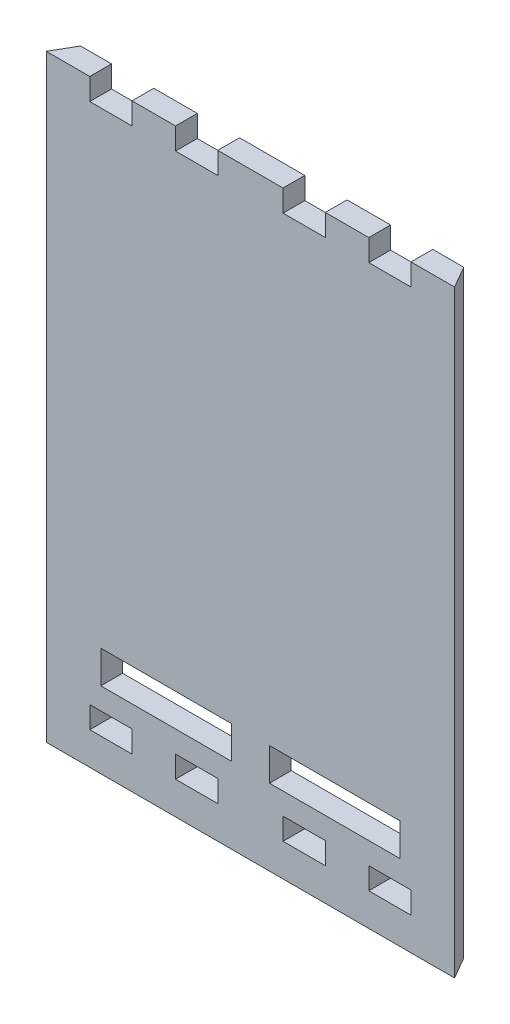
from build123d import *

# Parameters (mm, degrees)
SKETCH1_W           = 3.881941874
SKETCH1_H           = 2
SKETCH1_W_2         = 3.881941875
BOSS_EXTRUDE1_DEPTH = 2
CUT_EXTRUDE1_DEPTH  = 67.613311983
SKETCH4_W           = 12
SKETCH4_H           = 3
CUT_EXTRUDE3_DEPTH  = 2


with BuildPart() as part:
    # Sketch1 → Boss-Extrude1 (new body)
    with BuildSketch(Plane.XY):
        Polygon((0, 50), (0, 0), (0, -2), (0, -5), (37.527767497, -5), (37.527767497, -2), (37.527767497, 0), (37.527767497, 50), (33.527767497, 50), (33.527767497, 48), (29.645825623, 48), (29.645825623, 50), (25.645825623, 50), (25.645825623, 48), (21.763883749, 48), (21.763883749, 50), (15.763883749, 50), (15.763883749, 48), (11.881941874, 48), (11.881941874, 50), (7.881941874, 50), (7.881941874, 48), (4, 48), (4, 50), align=None)
        with Locations((5.940970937, -1)):
            Rectangle(SKETCH1_W, SKETCH1_H, mode=Mode.SUBTRACT)
        with Locations((13.822912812, -1)):
            Rectangle(SKETCH1_W_2, SKETCH1_H, mode=Mode.SUBTRACT)
        with Locations((23.704854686, -1)):
            Rectangle(SKETCH1_W, SKETCH1_H, mode=Mode.SUBTRACT)
        with Locations((31.58679656, -1)):
            Rectangle(SKETCH1_W, SKETCH1_H, mode=Mode.SUBTRACT)
    extrude(amount=BOSS_EXTRUDE1_DEPTH)

    # Sketch2 → Cut-Extrude1 (cut, through all)
    with BuildSketch(Plane(origin=(0, 50, 0), x_dir=(1, 0, 0), z_dir=(0, 1, 0))):
        Polygon((1.154700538, 0), (0, -2), (0, 0), align=None)
        Polygon((37.527767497, 0), (36.373066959, 0), (37.527767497, -2), align=None)
    extrude(amount=-CUT_EXTRUDE1_DEPTH, mode=Mode.SUBTRACT)

    # Sketch4 → Cut-Extrude3 (cut)
    with BuildSketch(Plane.XY.offset(2)):
        with Locations((11.013883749, 3.5)):
            Rectangle(SKETCH4_W, SKETCH4_H)
        with Locations((26.513883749, 3.5)):
            Rectangle(SKETCH4_W, SKETCH4_H)
    extrude(amount=-CUT_EXTRUDE3_DEPTH, mode=Mode.SUBTRACT)


solid = part.part
